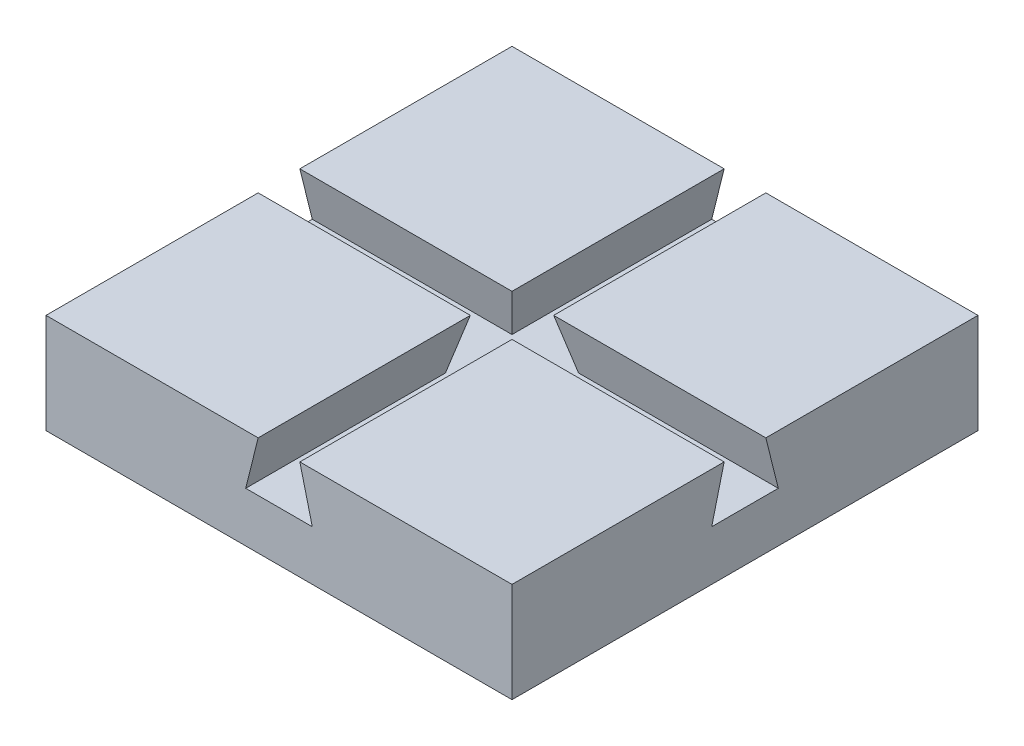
from build123d import *

# Parameters (mm, degrees)
SKETCH1_W          = 88.9
SKETCH1_H          = 88.9
BASE_EXTRUDE_DEPTH = 19.05
CUT_EXTRUDE1_DEPTH = 102.202346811
CUT_EXTRUDE2_DEPTH = 103.21917076


with BuildPart() as part:
    # Sketch1 → Base-Extrude (new body)
    with BuildSketch(Plane(origin=(0, 0, 0), x_dir=(1, 0, 0), z_dir=(0, 1, 0))):
        Rectangle(SKETCH1_W, SKETCH1_H)
    extrude(amount=BASE_EXTRUDE_DEPTH)

    # Sketch2 → Cut-Extrude1 (cut, through all)
    with BuildSketch(Plane.XY.offset(44.45)):
        Polygon((6.35, 9.525), (-6.35, 9.525), (-3.975150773, 19.05), (3.975150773, 19.05), align=None)
    extrude(amount=-CUT_EXTRUDE1_DEPTH, mode=Mode.SUBTRACT)

    # Sketch3 → Cut-Extrude2 (cut, through all)
    with BuildSketch(Plane(origin=(44.45, -3.538159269, -0.664564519), x_dir=(0, 0, -1), z_dir=(1, 0, 0))):
        Polygon((5.685435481, 13.063159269), (-7.014564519, 13.063159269), (-4.639715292, 22.588159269), (3.310586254, 22.588159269), align=None)
    extrude(amount=-CUT_EXTRUDE2_DEPTH, mode=Mode.SUBTRACT)


solid = part.part
